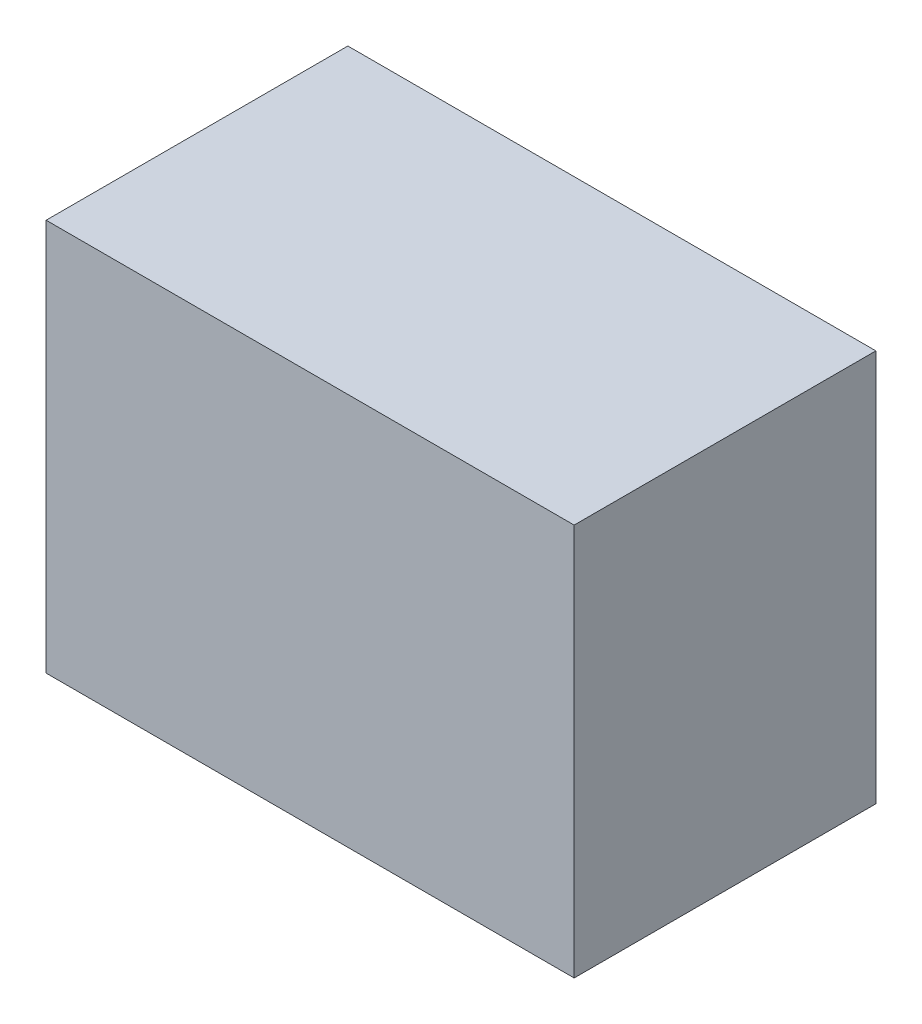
ISO-10303-21;
HEADER;
FILE_DESCRIPTION(('STEP AP214'),'2;1');
FILE_NAME('part.step','',(''),(''),'','','');
FILE_SCHEMA(('AUTOMOTIVE_DESIGN { 1 0 10303 214 1 1 1 1 }'));
ENDSEC;
DATA;
#1=APPLICATION_CONTEXT('core data for automotive mechanical design processes');
#2=APPLICATION_PROTOCOL_DEFINITION('international standard','automotive_design',2000,#1);
#3=PRODUCT_CONTEXT('',#1,'mechanical');
#4=PRODUCT('Part','Part','',(#3));
#5=PRODUCT_RELATED_PRODUCT_CATEGORY('part','',(#4));
#6=PRODUCT_DEFINITION_FORMATION('','',#4);
#7=PRODUCT_DEFINITION_CONTEXT('part definition',#1,'design');
#8=PRODUCT_DEFINITION('design','',#6,#7);
#9=PRODUCT_DEFINITION_SHAPE('','',#8);
#10=(LENGTH_UNIT() NAMED_UNIT(*) SI_UNIT(.MILLI.,.METRE.));
#11=(NAMED_UNIT(*) PLANE_ANGLE_UNIT() SI_UNIT($,.RADIAN.));
#12=(NAMED_UNIT(*) SI_UNIT($,.STERADIAN.) SOLID_ANGLE_UNIT());
#13=UNCERTAINTY_MEASURE_WITH_UNIT(LENGTH_MEASURE(1.E-05),#10,'distance_accuracy_value','');
#14=(GEOMETRIC_REPRESENTATION_CONTEXT(3) GLOBAL_UNCERTAINTY_ASSIGNED_CONTEXT((#13)) GLOBAL_UNIT_ASSIGNED_CONTEXT((#10,
#11,#12)) REPRESENTATION_CONTEXT('',''));
#15=CARTESIAN_POINT('',(0.,0.,0.));
#16=DIRECTION('',(0.,0.,1.));
#17=DIRECTION('',(1.,0.,0.));
#18=AXIS2_PLACEMENT_3D('',#15,#16,#17);
#19=CARTESIAN_POINT('',(0.,0.,20.));
#20=DIRECTION('',(1.,0.,0.));
#21=DIRECTION('',(0.,0.,-1.));
#22=AXIS2_PLACEMENT_3D('',#19,#20,#21);
#23=PLANE('',#22);
#24=CARTESIAN_POINT('',(0.,13.,10.));
#25=DIRECTION('',(-1.,0.,0.));
#26=DIRECTION('',(0.,0.,1.));
#27=AXIS2_PLACEMENT_3D('',#24,#25,#26);
#28=CIRCLE('',#27,5.25);
#29=CARTESIAN_POINT('',(0.,13.,15.25));
#30=VERTEX_POINT('',#29);
#31=EDGE_CURVE('E79',#30,#30,#28,.T.);
#32=ORIENTED_EDGE('',*,*,#31,.F.);
#33=EDGE_LOOP('',(#32));
#34=FACE_BOUND('',#33,.T.);
#35=DIRECTION('',(0.,-1.,0.));
#36=VECTOR('',#35,1.);
#37=CARTESIAN_POINT('',(0.,0.,0.));
#38=LINE('',#37,#36);
#39=CARTESIAN_POINT('',(0.,26.,0.));
#40=VERTEX_POINT('',#39);
#41=CARTESIAN_POINT('',(0.,0.,0.));
#42=VERTEX_POINT('',#41);
#43=EDGE_CURVE('E82',#40,#42,#38,.T.);
#44=ORIENTED_EDGE('',*,*,#43,.T.);
#45=DIRECTION('',(0.,0.,-1.));
#46=VECTOR('',#45,1.);
#47=CARTESIAN_POINT('',(0.,0.,20.));
#48=LINE('',#47,#46);
#49=CARTESIAN_POINT('',(0.,0.,20.));
#50=VERTEX_POINT('',#49);
#51=EDGE_CURVE('E11',#50,#42,#48,.T.);
#52=ORIENTED_EDGE('',*,*,#51,.F.);
#53=DIRECTION('',(0.,-1.,0.));
#54=VECTOR('',#53,1.);
#55=CARTESIAN_POINT('',(0.,0.,20.));
#56=LINE('',#55,#54);
#57=CARTESIAN_POINT('',(0.,26.,20.));
#58=VERTEX_POINT('',#57);
#59=EDGE_CURVE('E93',#58,#50,#56,.T.);
#60=ORIENTED_EDGE('',*,*,#59,.F.);
#61=DIRECTION('',(0.,0.,-1.));
#62=VECTOR('',#61,1.);
#63=CARTESIAN_POINT('',(0.,26.,20.));
#64=LINE('',#63,#62);
#65=EDGE_CURVE('E99',#58,#40,#64,.T.);
#66=ORIENTED_EDGE('',*,*,#65,.T.);
#67=EDGE_LOOP('',(#44,#52,#60,#66));
#68=FACE_BOUND('',#67,.T.);
#69=ADVANCED_FACE('F29',(#34,#68),#23,.F.);
#70=CARTESIAN_POINT('',(0.,0.,20.));
#71=DIRECTION('',(0.,1.,0.));
#72=DIRECTION('',(0.,0.,1.));
#73=AXIS2_PLACEMENT_3D('',#70,#71,#72);
#74=PLANE('',#73);
#75=DIRECTION('',(1.,0.,0.));
#76=VECTOR('',#75,1.);
#77=CARTESIAN_POINT('',(0.,0.,0.));
#78=LINE('',#77,#76);
#79=CARTESIAN_POINT('',(35.,0.,0.));
#80=VERTEX_POINT('',#79);
#81=EDGE_CURVE('E87',#42,#80,#78,.T.);
#82=ORIENTED_EDGE('',*,*,#81,.T.);
#83=DIRECTION('',(0.,0.,-1.));
#84=VECTOR('',#83,1.);
#85=CARTESIAN_POINT('',(35.,0.,20.));
#86=LINE('',#85,#84);
#87=CARTESIAN_POINT('',(35.,0.,20.));
#88=VERTEX_POINT('',#87);
#89=EDGE_CURVE('E36',#88,#80,#86,.T.);
#90=ORIENTED_EDGE('',*,*,#89,.F.);
#91=DIRECTION('',(1.,0.,0.));
#92=VECTOR('',#91,1.);
#93=CARTESIAN_POINT('',(0.,0.,20.));
#94=LINE('',#93,#92);
#95=EDGE_CURVE('E95',#50,#88,#94,.T.);
#96=ORIENTED_EDGE('',*,*,#95,.F.);
#97=ORIENTED_EDGE('',*,*,#51,.T.);
#98=EDGE_LOOP('',(#82,#90,#96,#97));
#99=FACE_BOUND('',#98,.T.);
#100=ADVANCED_FACE('F120',(#99),#74,.F.);
#101=CARTESIAN_POINT('',(35.,0.,20.));
#102=DIRECTION('',(-1.,0.,0.));
#103=DIRECTION('',(0.,0.,1.));
#104=AXIS2_PLACEMENT_3D('',#101,#102,#103);
#105=PLANE('',#104);
#106=DIRECTION('',(0.,1.,0.));
#107=VECTOR('',#106,1.);
#108=CARTESIAN_POINT('',(35.,0.,0.));
#109=LINE('',#108,#107);
#110=CARTESIAN_POINT('',(35.,26.,0.));
#111=VERTEX_POINT('',#110);
#112=EDGE_CURVE('E89',#80,#111,#109,.T.);
#113=ORIENTED_EDGE('',*,*,#112,.T.);
#114=DIRECTION('',(0.,0.,-1.));
#115=VECTOR('',#114,1.);
#116=CARTESIAN_POINT('',(35.,26.,20.));
#117=LINE('',#116,#115);
#118=CARTESIAN_POINT('',(35.,26.,20.));
#119=VERTEX_POINT('',#118);
#120=EDGE_CURVE('E102',#119,#111,#117,.T.);
#121=ORIENTED_EDGE('',*,*,#120,.F.);
#122=DIRECTION('',(0.,1.,0.));
#123=VECTOR('',#122,1.);
#124=CARTESIAN_POINT('',(35.,0.,20.));
#125=LINE('',#124,#123);
#126=EDGE_CURVE('E48',#88,#119,#125,.T.);
#127=ORIENTED_EDGE('',*,*,#126,.F.);
#128=ORIENTED_EDGE('',*,*,#89,.T.);
#129=EDGE_LOOP('',(#113,#121,#127,#128));
#130=FACE_BOUND('',#129,.T.);
#131=ADVANCED_FACE('F108',(#130),#105,.F.);
#132=CARTESIAN_POINT('',(0.,26.,20.));
#133=DIRECTION('',(0.,-1.,0.));
#134=DIRECTION('',(0.,0.,-1.));
#135=AXIS2_PLACEMENT_3D('',#132,#133,#134);
#136=PLANE('',#135);
#137=DIRECTION('',(-1.,0.,0.));
#138=VECTOR('',#137,1.);
#139=CARTESIAN_POINT('',(0.,26.,0.));
#140=LINE('',#139,#138);
#141=EDGE_CURVE('E91',#111,#40,#140,.T.);
#142=ORIENTED_EDGE('',*,*,#141,.T.);
#143=ORIENTED_EDGE('',*,*,#65,.F.);
#144=DIRECTION('',(-1.,0.,0.));
#145=VECTOR('',#144,1.);
#146=CARTESIAN_POINT('',(0.,26.,20.));
#147=LINE('',#146,#145);
#148=EDGE_CURVE('E43',#119,#58,#147,.T.);
#149=ORIENTED_EDGE('',*,*,#148,.F.);
#150=ORIENTED_EDGE('',*,*,#120,.T.);
#151=EDGE_LOOP('',(#142,#143,#149,#150));
#152=FACE_BOUND('',#151,.T.);
#153=ADVANCED_FACE('F115',(#152),#136,.F.);
#154=CARTESIAN_POINT('',(0.,26.,20.));
#155=DIRECTION('',(0.,0.,-1.));
#156=DIRECTION('',(-1.,0.,0.));
#157=AXIS2_PLACEMENT_3D('',#154,#155,#156);
#158=PLANE('',#157);
#159=ORIENTED_EDGE('',*,*,#59,.T.);
#160=ORIENTED_EDGE('',*,*,#95,.T.);
#161=ORIENTED_EDGE('',*,*,#126,.T.);
#162=ORIENTED_EDGE('',*,*,#148,.T.);
#163=EDGE_LOOP('',(#159,#160,#161,#162));
#164=FACE_BOUND('',#163,.T.);
#165=ADVANCED_FACE('F119',(#164),#158,.F.);
#166=CARTESIAN_POINT('',(0.,26.,0.));
#167=DIRECTION('',(0.,0.,-1.));
#168=DIRECTION('',(-1.,0.,0.));
#169=AXIS2_PLACEMENT_3D('',#166,#167,#168);
#170=PLANE('',#169);
#171=ORIENTED_EDGE('',*,*,#43,.F.);
#172=ORIENTED_EDGE('',*,*,#141,.F.);
#173=ORIENTED_EDGE('',*,*,#112,.F.);
#174=ORIENTED_EDGE('',*,*,#81,.F.);
#175=EDGE_LOOP('',(#171,#172,#173,#174));
#176=FACE_BOUND('',#175,.T.);
#177=ADVANCED_FACE('F113',(#176),#170,.T.);
#178=CARTESIAN_POINT('',(0.,13.,10.));
#179=DIRECTION('',(-1.,0.,0.));
#180=DIRECTION('',(0.,0.,1.));
#181=AXIS2_PLACEMENT_3D('',#178,#179,#180);
#182=CYLINDRICAL_SURFACE('',#181,5.25);
#183=CARTESIAN_POINT('',(26.5,13.,10.));
#184=DIRECTION('',(-1.,0.,0.));
#185=DIRECTION('',(0.,0.,1.));
#186=AXIS2_PLACEMENT_3D('',#183,#184,#185);
#187=CIRCLE('',#186,5.25);
#188=CARTESIAN_POINT('',(26.5,13.,15.25));
#189=VERTEX_POINT('',#188);
#190=EDGE_CURVE('E77',#189,#189,#187,.T.);
#191=ORIENTED_EDGE('',*,*,#190,.F.);
#192=EDGE_LOOP('',(#191));
#193=FACE_BOUND('',#192,.T.);
#194=ORIENTED_EDGE('',*,*,#31,.T.);
#195=EDGE_LOOP('',(#194));
#196=FACE_BOUND('',#195,.T.);
#197=ADVANCED_FACE('F73',(#193,#196),#182,.F.);
#198=CARTESIAN_POINT('',(26.5,13.,10.));
#199=DIRECTION('',(-1.,0.,0.));
#200=DIRECTION('',(0.,0.,1.));
#201=AXIS2_PLACEMENT_3D('',#198,#199,#200);
#202=CONICAL_SURFACE('',#201,5.25,1.02974425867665);
#203=CARTESIAN_POINT('',(29.6545182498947,13.,10.));
#204=VERTEX_POINT('',#203);
#205=VERTEX_LOOP('',#204);
#206=FACE_BOUND('',#205,.T.);
#207=ORIENTED_EDGE('',*,*,#190,.T.);
#208=EDGE_LOOP('',(#207));
#209=FACE_BOUND('',#208,.T.);
#210=ADVANCED_FACE('F70',(#206,#209),#202,.F.);
#211=CLOSED_SHELL('',(#69,#100,#131,#153,#165,#177,#197,#210));
#212=MANIFOLD_SOLID_BREP('B2',#211);
#213=ADVANCED_BREP_SHAPE_REPRESENTATION('',(#18,#212),#14);
#214=SHAPE_DEFINITION_REPRESENTATION(#9,#213);
ENDSEC;
END-ISO-10303-21;
